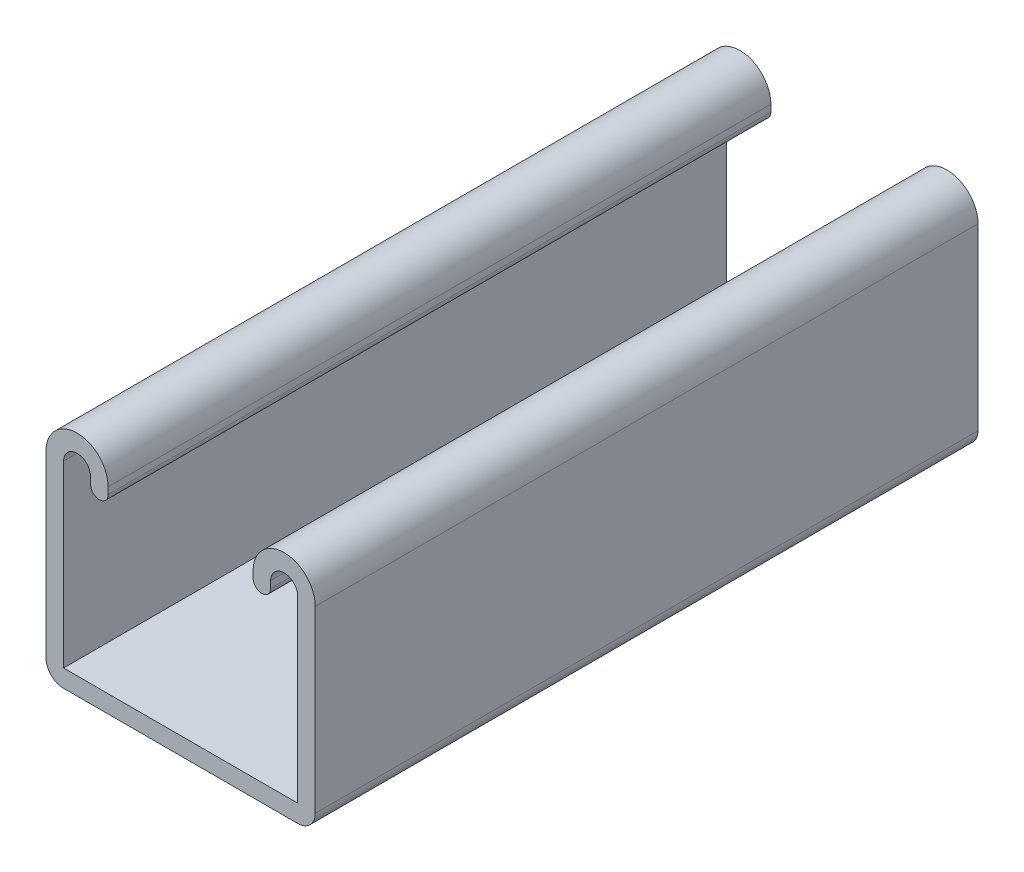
ISO-10303-21;
HEADER;
FILE_DESCRIPTION(('STEP AP214'),'2;1');
FILE_NAME('part.step','',(''),(''),'','','');
FILE_SCHEMA(('AUTOMOTIVE_DESIGN { 1 0 10303 214 1 1 1 1 }'));
ENDSEC;
DATA;
#1=APPLICATION_CONTEXT('core data for automotive mechanical design processes');
#2=APPLICATION_PROTOCOL_DEFINITION('international standard','automotive_design',2000,#1);
#3=PRODUCT_CONTEXT('',#1,'mechanical');
#4=PRODUCT('Part','Part','',(#3));
#5=PRODUCT_RELATED_PRODUCT_CATEGORY('part','',(#4));
#6=PRODUCT_DEFINITION_FORMATION('','',#4);
#7=PRODUCT_DEFINITION_CONTEXT('part definition',#1,'design');
#8=PRODUCT_DEFINITION('design','',#6,#7);
#9=PRODUCT_DEFINITION_SHAPE('','',#8);
#10=(LENGTH_UNIT() NAMED_UNIT(*) SI_UNIT(.MILLI.,.METRE.));
#11=(NAMED_UNIT(*) PLANE_ANGLE_UNIT() SI_UNIT($,.RADIAN.));
#12=(NAMED_UNIT(*) SI_UNIT($,.STERADIAN.) SOLID_ANGLE_UNIT());
#13=UNCERTAINTY_MEASURE_WITH_UNIT(LENGTH_MEASURE(1.E-05),#10,'distance_accuracy_value','');
#14=(GEOMETRIC_REPRESENTATION_CONTEXT(3) GLOBAL_UNCERTAINTY_ASSIGNED_CONTEXT((#13)) GLOBAL_UNIT_ASSIGNED_CONTEXT((#10,
#11,#12)) REPRESENTATION_CONTEXT('',''));
#15=CARTESIAN_POINT('',(0.,0.,0.));
#16=DIRECTION('',(0.,0.,1.));
#17=DIRECTION('',(1.,0.,0.));
#18=AXIS2_PLACEMENT_3D('',#15,#16,#17);
#19=CARTESIAN_POINT('',(-15.875,15.1511,101.6));
#20=DIRECTION('',(0.,0.,-1.));
#21=DIRECTION('',(-1.,0.,0.));
#22=AXIS2_PLACEMENT_3D('',#19,#20,#21);
#23=CYLINDRICAL_SURFACE('',#22,4.7625);
#24=CARTESIAN_POINT('',(-15.875,15.1511,0.));
#25=DIRECTION('',(0.,0.,1.));
#26=DIRECTION('',(-1.,0.,0.));
#27=AXIS2_PLACEMENT_3D('',#24,#25,#26);
#28=CIRCLE('',#27,4.7625);
#29=CARTESIAN_POINT('',(-11.1125,15.1511,0.));
#30=VERTEX_POINT('',#29);
#31=CARTESIAN_POINT('',(-20.6375,15.1511,0.));
#32=VERTEX_POINT('',#31);
#33=EDGE_CURVE('E190',#30,#32,#28,.T.);
#34=ORIENTED_EDGE('',*,*,#33,.T.);
#35=DIRECTION('',(0.,0.,-1.));
#36=VECTOR('',#35,1.);
#37=CARTESIAN_POINT('',(-20.6375,15.1511,101.6));
#38=LINE('',#37,#36);
#39=CARTESIAN_POINT('',(-20.6375,15.1511,101.6));
#40=VERTEX_POINT('',#39);
#41=EDGE_CURVE('E11',#40,#32,#38,.T.);
#42=ORIENTED_EDGE('',*,*,#41,.F.);
#43=CARTESIAN_POINT('',(-15.875,15.1511,101.6));
#44=DIRECTION('',(0.,0.,1.));
#45=DIRECTION('',(-1.,0.,0.));
#46=AXIS2_PLACEMENT_3D('',#43,#44,#45);
#47=CIRCLE('',#46,4.7625);
#48=CARTESIAN_POINT('',(-11.1125,15.1511,101.6));
#49=VERTEX_POINT('',#48);
#50=EDGE_CURVE('E224',#49,#40,#47,.T.);
#51=ORIENTED_EDGE('',*,*,#50,.F.);
#52=DIRECTION('',(0.,0.,-1.));
#53=VECTOR('',#52,1.);
#54=CARTESIAN_POINT('',(-11.1125,15.1511,101.6));
#55=LINE('',#54,#53);
#56=EDGE_CURVE('E186',#49,#30,#55,.T.);
#57=ORIENTED_EDGE('',*,*,#56,.T.);
#58=EDGE_LOOP('',(#34,#42,#51,#57));
#59=FACE_BOUND('',#58,.T.);
#60=ADVANCED_FACE('F33',(#59),#23,.T.);
#61=CARTESIAN_POINT('',(-20.6375,15.1511,101.6));
#62=DIRECTION('',(1.,0.,0.));
#63=DIRECTION('',(0.,1.,0.));
#64=AXIS2_PLACEMENT_3D('',#61,#62,#63);
#65=PLANE('',#64);
#66=DIRECTION('',(0.,-1.,0.));
#67=VECTOR('',#66,1.);
#68=CARTESIAN_POINT('',(-20.6375,15.1511,0.));
#69=LINE('',#68,#67);
#70=CARTESIAN_POINT('',(-20.6375,-12.319,0.));
#71=VERTEX_POINT('',#70);
#72=EDGE_CURVE('E193',#32,#71,#69,.T.);
#73=ORIENTED_EDGE('',*,*,#72,.T.);
#74=DIRECTION('',(0.,0.,-1.));
#75=VECTOR('',#74,1.);
#76=CARTESIAN_POINT('',(-20.6375,-12.319,101.6));
#77=LINE('',#76,#75);
#78=CARTESIAN_POINT('',(-20.6375,-12.319,101.6));
#79=VERTEX_POINT('',#78);
#80=EDGE_CURVE('E42',#79,#71,#77,.T.);
#81=ORIENTED_EDGE('',*,*,#80,.F.);
#82=DIRECTION('',(0.,-1.,0.));
#83=VECTOR('',#82,1.);
#84=CARTESIAN_POINT('',(-20.6375,15.1511,101.6));
#85=LINE('',#84,#83);
#86=EDGE_CURVE('E123',#40,#79,#85,.T.);
#87=ORIENTED_EDGE('',*,*,#86,.F.);
#88=ORIENTED_EDGE('',*,*,#41,.T.);
#89=EDGE_LOOP('',(#73,#81,#87,#88));
#90=FACE_BOUND('',#89,.T.);
#91=ADVANCED_FACE('F333',(#90),#65,.F.);
#92=CARTESIAN_POINT('',(-17.9451,-12.319,101.6));
#93=DIRECTION('',(0.,0.,-1.));
#94=DIRECTION('',(-1.,0.,0.));
#95=AXIS2_PLACEMENT_3D('',#92,#93,#94);
#96=CYLINDRICAL_SURFACE('',#95,2.6924);
#97=CARTESIAN_POINT('',(-17.9451,-12.319,0.));
#98=DIRECTION('',(0.,0.,1.));
#99=DIRECTION('',(-1.,0.,0.));
#100=AXIS2_PLACEMENT_3D('',#97,#98,#99);
#101=CIRCLE('',#100,2.6924);
#102=CARTESIAN_POINT('',(-17.9451,-15.0114,0.));
#103=VERTEX_POINT('',#102);
#104=EDGE_CURVE('E195',#71,#103,#101,.T.);
#105=ORIENTED_EDGE('',*,*,#104,.T.);
#106=DIRECTION('',(0.,0.,-1.));
#107=VECTOR('',#106,1.);
#108=CARTESIAN_POINT('',(-17.9451,-15.0114,101.6));
#109=LINE('',#108,#107);
#110=CARTESIAN_POINT('',(-17.9451,-15.0114,101.6));
#111=VERTEX_POINT('',#110);
#112=EDGE_CURVE('E261',#111,#103,#109,.T.);
#113=ORIENTED_EDGE('',*,*,#112,.F.);
#114=CARTESIAN_POINT('',(-17.9451,-12.319,101.6));
#115=DIRECTION('',(0.,0.,1.));
#116=DIRECTION('',(-1.,0.,0.));
#117=AXIS2_PLACEMENT_3D('',#114,#115,#116);
#118=CIRCLE('',#117,2.6924);
#119=EDGE_CURVE('E270',#79,#111,#118,.T.);
#120=ORIENTED_EDGE('',*,*,#119,.F.);
#121=ORIENTED_EDGE('',*,*,#80,.T.);
#122=EDGE_LOOP('',(#105,#113,#120,#121));
#123=FACE_BOUND('',#122,.T.);
#124=ADVANCED_FACE('F268',(#123),#96,.T.);
#125=CARTESIAN_POINT('',(-17.9451,-15.0114,101.6));
#126=DIRECTION('',(0.,1.,0.));
#127=DIRECTION('',(-1.,0.,0.));
#128=AXIS2_PLACEMENT_3D('',#125,#126,#127);
#129=PLANE('',#128);
#130=CARTESIAN_POINT('',(0.,-15.0114,71.4375));
#131=DIRECTION('',(0.,-1.,0.));
#132=DIRECTION('',(1.,0.,0.));
#133=AXIS2_PLACEMENT_3D('',#130,#131,#132);
#134=CIRCLE('',#133,7.14375);
#135=CARTESIAN_POINT('',(7.14375,-15.0114,71.4375));
#136=VERTEX_POINT('',#135);
#137=EDGE_CURVE('E452',#136,#136,#134,.T.);
#138=ORIENTED_EDGE('',*,*,#137,.F.);
#139=EDGE_LOOP('',(#138));
#140=FACE_BOUND('',#139,.T.);
#141=CARTESIAN_POINT('',(0.,-15.0114,23.8125));
#142=DIRECTION('',(0.,-1.,0.));
#143=DIRECTION('',(1.,0.,0.));
#144=AXIS2_PLACEMENT_3D('',#141,#142,#143);
#145=CIRCLE('',#144,7.14375);
#146=CARTESIAN_POINT('',(7.14375,-15.0114,23.8125));
#147=VERTEX_POINT('',#146);
#148=EDGE_CURVE('E456',#147,#147,#145,.T.);
#149=ORIENTED_EDGE('',*,*,#148,.F.);
#150=EDGE_LOOP('',(#149));
#151=FACE_BOUND('',#150,.T.);
#152=DIRECTION('',(1.,0.,0.));
#153=VECTOR('',#152,1.);
#154=CARTESIAN_POINT('',(-17.9451,-15.0114,0.));
#155=LINE('',#154,#153);
#156=CARTESIAN_POINT('',(17.9451,-15.0114,0.));
#157=VERTEX_POINT('',#156);
#158=EDGE_CURVE('E197',#103,#157,#155,.T.);
#159=ORIENTED_EDGE('',*,*,#158,.T.);
#160=DIRECTION('',(0.,0.,-1.));
#161=VECTOR('',#160,1.);
#162=CARTESIAN_POINT('',(17.9451,-15.0114,101.6));
#163=LINE('',#162,#161);
#164=CARTESIAN_POINT('',(17.9451,-15.0114,101.6));
#165=VERTEX_POINT('',#164);
#166=EDGE_CURVE('E258',#165,#157,#163,.T.);
#167=ORIENTED_EDGE('',*,*,#166,.F.);
#168=DIRECTION('',(1.,0.,0.));
#169=VECTOR('',#168,1.);
#170=CARTESIAN_POINT('',(-17.9451,-15.0114,101.6));
#171=LINE('',#170,#169);
#172=EDGE_CURVE('E288',#111,#165,#171,.T.);
#173=ORIENTED_EDGE('',*,*,#172,.F.);
#174=ORIENTED_EDGE('',*,*,#112,.T.);
#175=EDGE_LOOP('',(#159,#167,#173,#174));
#176=FACE_BOUND('',#175,.T.);
#177=ADVANCED_FACE('F279',(#140,#151,#176),#129,.F.);
#178=CARTESIAN_POINT('',(17.9451,-12.319,101.6));
#179=DIRECTION('',(0.,0.,-1.));
#180=DIRECTION('',(-1.,0.,0.));
#181=AXIS2_PLACEMENT_3D('',#178,#179,#180);
#182=CYLINDRICAL_SURFACE('',#181,2.6924);
#183=CARTESIAN_POINT('',(17.9451,-12.319,0.));
#184=DIRECTION('',(0.,0.,1.));
#185=DIRECTION('',(1.,0.,0.));
#186=AXIS2_PLACEMENT_3D('',#183,#184,#185);
#187=CIRCLE('',#186,2.6924);
#188=CARTESIAN_POINT('',(20.6375,-12.319,0.));
#189=VERTEX_POINT('',#188);
#190=EDGE_CURVE('E199',#157,#189,#187,.T.);
#191=ORIENTED_EDGE('',*,*,#190,.T.);
#192=DIRECTION('',(0.,0.,-1.));
#193=VECTOR('',#192,1.);
#194=CARTESIAN_POINT('',(20.6375,-12.319,101.6));
#195=LINE('',#194,#193);
#196=CARTESIAN_POINT('',(20.6375,-12.319,101.6));
#197=VERTEX_POINT('',#196);
#198=EDGE_CURVE('E255',#197,#189,#195,.T.);
#199=ORIENTED_EDGE('',*,*,#198,.F.);
#200=CARTESIAN_POINT('',(17.9451,-12.319,101.6));
#201=DIRECTION('',(0.,0.,1.));
#202=DIRECTION('',(1.,0.,0.));
#203=AXIS2_PLACEMENT_3D('',#200,#201,#202);
#204=CIRCLE('',#203,2.6924);
#205=EDGE_CURVE('E285',#165,#197,#204,.T.);
#206=ORIENTED_EDGE('',*,*,#205,.F.);
#207=ORIENTED_EDGE('',*,*,#166,.T.);
#208=EDGE_LOOP('',(#191,#199,#206,#207));
#209=FACE_BOUND('',#208,.T.);
#210=ADVANCED_FACE('F283',(#209),#182,.T.);
#211=CARTESIAN_POINT('',(20.6375,-12.319,101.6));
#212=DIRECTION('',(-1.,0.,0.));
#213=DIRECTION('',(0.,0.,1.));
#214=AXIS2_PLACEMENT_3D('',#211,#212,#213);
#215=PLANE('',#214);
#216=DIRECTION('',(0.,1.,0.));
#217=VECTOR('',#216,1.);
#218=CARTESIAN_POINT('',(20.6375,-12.319,0.));
#219=LINE('',#218,#217);
#220=CARTESIAN_POINT('',(20.6375,15.1511,0.));
#221=VERTEX_POINT('',#220);
#222=EDGE_CURVE('E201',#189,#221,#219,.T.);
#223=ORIENTED_EDGE('',*,*,#222,.T.);
#224=DIRECTION('',(0.,0.,-1.));
#225=VECTOR('',#224,1.);
#226=CARTESIAN_POINT('',(20.6375,15.1511,101.6));
#227=LINE('',#226,#225);
#228=CARTESIAN_POINT('',(20.6375,15.1511,101.6));
#229=VERTEX_POINT('',#228);
#230=EDGE_CURVE('E252',#229,#221,#227,.T.);
#231=ORIENTED_EDGE('',*,*,#230,.F.);
#232=DIRECTION('',(0.,1.,0.));
#233=VECTOR('',#232,1.);
#234=CARTESIAN_POINT('',(20.6375,-12.319,101.6));
#235=LINE('',#234,#233);
#236=EDGE_CURVE('E287',#197,#229,#235,.T.);
#237=ORIENTED_EDGE('',*,*,#236,.F.);
#238=ORIENTED_EDGE('',*,*,#198,.T.);
#239=EDGE_LOOP('',(#223,#231,#237,#238));
#240=FACE_BOUND('',#239,.T.);
#241=ADVANCED_FACE('F347',(#240),#215,.F.);
#242=CARTESIAN_POINT('',(15.875,15.1511,101.6));
#243=DIRECTION('',(0.,0.,-1.));
#244=DIRECTION('',(-1.,0.,0.));
#245=AXIS2_PLACEMENT_3D('',#242,#243,#244);
#246=CYLINDRICAL_SURFACE('',#245,4.7625);
#247=CARTESIAN_POINT('',(15.875,15.1511,0.));
#248=DIRECTION('',(0.,0.,1.));
#249=DIRECTION('',(1.,0.,0.));
#250=AXIS2_PLACEMENT_3D('',#247,#248,#249);
#251=CIRCLE('',#250,4.7625);
#252=CARTESIAN_POINT('',(11.1125,15.1511,0.));
#253=VERTEX_POINT('',#252);
#254=EDGE_CURVE('E203',#221,#253,#251,.T.);
#255=ORIENTED_EDGE('',*,*,#254,.T.);
#256=DIRECTION('',(0.,0.,-1.));
#257=VECTOR('',#256,1.);
#258=CARTESIAN_POINT('',(11.1125,15.1511,101.6));
#259=LINE('',#258,#257);
#260=CARTESIAN_POINT('',(11.1125,15.1511,101.6));
#261=VERTEX_POINT('',#260);
#262=EDGE_CURVE('E249',#261,#253,#259,.T.);
#263=ORIENTED_EDGE('',*,*,#262,.F.);
#264=CARTESIAN_POINT('',(15.875,15.1511,101.6));
#265=DIRECTION('',(0.,0.,1.));
#266=DIRECTION('',(1.,0.,0.));
#267=AXIS2_PLACEMENT_3D('',#264,#265,#266);
#268=CIRCLE('',#267,4.7625);
#269=EDGE_CURVE('E290',#229,#261,#268,.T.);
#270=ORIENTED_EDGE('',*,*,#269,.F.);
#271=ORIENTED_EDGE('',*,*,#230,.T.);
#272=EDGE_LOOP('',(#255,#263,#270,#271));
#273=FACE_BOUND('',#272,.T.);
#274=ADVANCED_FACE('F350',(#273),#246,.T.);
#275=CARTESIAN_POINT('',(11.1125,15.1511,101.6));
#276=DIRECTION('',(1.,0.,0.));
#277=DIRECTION('',(0.,1.,0.));
#278=AXIS2_PLACEMENT_3D('',#275,#276,#277);
#279=PLANE('',#278);
#280=DIRECTION('',(0.,-1.,0.));
#281=VECTOR('',#280,1.);
#282=CARTESIAN_POINT('',(11.1125,15.1511,0.));
#283=LINE('',#282,#281);
#284=CARTESIAN_POINT('',(11.1125,14.11605,0.));
#285=VERTEX_POINT('',#284);
#286=EDGE_CURVE('E205',#253,#285,#283,.T.);
#287=ORIENTED_EDGE('',*,*,#286,.T.);
#288=DIRECTION('',(0.,0.,-1.));
#289=VECTOR('',#288,1.);
#290=CARTESIAN_POINT('',(11.1125,14.11605,101.6));
#291=LINE('',#290,#289);
#292=CARTESIAN_POINT('',(11.1125,14.11605,101.6));
#293=VERTEX_POINT('',#292);
#294=EDGE_CURVE('E246',#293,#285,#291,.T.);
#295=ORIENTED_EDGE('',*,*,#294,.F.);
#296=DIRECTION('',(0.,-1.,0.));
#297=VECTOR('',#296,1.);
#298=CARTESIAN_POINT('',(11.1125,15.1511,101.6));
#299=LINE('',#298,#297);
#300=EDGE_CURVE('E296',#261,#293,#299,.T.);
#301=ORIENTED_EDGE('',*,*,#300,.F.);
#302=ORIENTED_EDGE('',*,*,#262,.T.);
#303=EDGE_LOOP('',(#287,#295,#301,#302));
#304=FACE_BOUND('',#303,.T.);
#305=ADVANCED_FACE('F354',(#304),#279,.F.);
#306=CARTESIAN_POINT('',(12.4587,14.11605,101.6));
#307=DIRECTION('',(0.,0.,-1.));
#308=DIRECTION('',(-1.,0.,0.));
#309=AXIS2_PLACEMENT_3D('',#306,#307,#308);
#310=CYLINDRICAL_SURFACE('',#309,1.3462);
#311=CARTESIAN_POINT('',(12.4587,14.11605,0.));
#312=DIRECTION('',(0.,0.,1.));
#313=DIRECTION('',(1.,0.,0.));
#314=AXIS2_PLACEMENT_3D('',#311,#312,#313);
#315=CIRCLE('',#314,1.3462);
#316=CARTESIAN_POINT('',(13.8049,14.11605,0.));
#317=VERTEX_POINT('',#316);
#318=EDGE_CURVE('E207',#285,#317,#315,.T.);
#319=ORIENTED_EDGE('',*,*,#318,.T.);
#320=DIRECTION('',(0.,0.,-1.));
#321=VECTOR('',#320,1.);
#322=CARTESIAN_POINT('',(13.8049,14.11605,101.6));
#323=LINE('',#322,#321);
#324=CARTESIAN_POINT('',(13.8049,14.11605,101.6));
#325=VERTEX_POINT('',#324);
#326=EDGE_CURVE('E243',#325,#317,#323,.T.);
#327=ORIENTED_EDGE('',*,*,#326,.F.);
#328=CARTESIAN_POINT('',(12.4587,14.11605,101.6));
#329=DIRECTION('',(0.,0.,1.));
#330=DIRECTION('',(1.,0.,0.));
#331=AXIS2_PLACEMENT_3D('',#328,#329,#330);
#332=CIRCLE('',#331,1.3462);
#333=EDGE_CURVE('E298',#293,#325,#332,.T.);
#334=ORIENTED_EDGE('',*,*,#333,.F.);
#335=ORIENTED_EDGE('',*,*,#294,.T.);
#336=EDGE_LOOP('',(#319,#327,#334,#335));
#337=FACE_BOUND('',#336,.T.);
#338=ADVANCED_FACE('F358',(#337),#310,.T.);
#339=CARTESIAN_POINT('',(13.8049,15.1511,101.6));
#340=DIRECTION('',(-1.,0.,0.));
#341=DIRECTION('',(0.,0.,1.));
#342=AXIS2_PLACEMENT_3D('',#339,#340,#341);
#343=PLANE('',#342);
#344=DIRECTION('',(0.,1.,0.));
#345=VECTOR('',#344,1.);
#346=CARTESIAN_POINT('',(13.8049,15.1511,0.));
#347=LINE('',#346,#345);
#348=CARTESIAN_POINT('',(13.8049,15.1511,0.));
#349=VERTEX_POINT('',#348);
#350=EDGE_CURVE('E209',#317,#349,#347,.T.);
#351=ORIENTED_EDGE('',*,*,#350,.T.);
#352=DIRECTION('',(0.,0.,-1.));
#353=VECTOR('',#352,1.);
#354=CARTESIAN_POINT('',(13.8049,15.1511,101.6));
#355=LINE('',#354,#353);
#356=CARTESIAN_POINT('',(13.8049,15.1511,101.6));
#357=VERTEX_POINT('',#356);
#358=EDGE_CURVE('E240',#357,#349,#355,.T.);
#359=ORIENTED_EDGE('',*,*,#358,.F.);
#360=DIRECTION('',(0.,1.,0.));
#361=VECTOR('',#360,1.);
#362=CARTESIAN_POINT('',(13.8049,15.1511,101.6));
#363=LINE('',#362,#361);
#364=EDGE_CURVE('E300',#325,#357,#363,.T.);
#365=ORIENTED_EDGE('',*,*,#364,.F.);
#366=ORIENTED_EDGE('',*,*,#326,.T.);
#367=EDGE_LOOP('',(#351,#359,#365,#366));
#368=FACE_BOUND('',#367,.T.);
#369=ADVANCED_FACE('F362',(#368),#343,.F.);
#370=CARTESIAN_POINT('',(15.875,15.1511,101.6));
#371=DIRECTION('',(0.,0.,-1.));
#372=DIRECTION('',(-1.,0.,0.));
#373=AXIS2_PLACEMENT_3D('',#370,#371,#372);
#374=CYLINDRICAL_SURFACE('',#373,2.0701);
#375=CARTESIAN_POINT('',(15.875,15.1511,0.));
#376=DIRECTION('',(0.,0.,-1.));
#377=DIRECTION('',(1.,0.,0.));
#378=AXIS2_PLACEMENT_3D('',#375,#376,#377);
#379=CIRCLE('',#378,2.0701);
#380=CARTESIAN_POINT('',(17.9451,15.1511,0.));
#381=VERTEX_POINT('',#380);
#382=EDGE_CURVE('E211',#349,#381,#379,.T.);
#383=ORIENTED_EDGE('',*,*,#382,.T.);
#384=DIRECTION('',(0.,0.,-1.));
#385=VECTOR('',#384,1.);
#386=CARTESIAN_POINT('',(17.9451,15.1511,101.6));
#387=LINE('',#386,#385);
#388=CARTESIAN_POINT('',(17.9451,15.1511,101.6));
#389=VERTEX_POINT('',#388);
#390=EDGE_CURVE('E237',#389,#381,#387,.T.);
#391=ORIENTED_EDGE('',*,*,#390,.F.);
#392=CARTESIAN_POINT('',(15.875,15.1511,101.6));
#393=DIRECTION('',(0.,0.,-1.));
#394=DIRECTION('',(1.,0.,0.));
#395=AXIS2_PLACEMENT_3D('',#392,#393,#394);
#396=CIRCLE('',#395,2.0701);
#397=EDGE_CURVE('E302',#357,#389,#396,.T.);
#398=ORIENTED_EDGE('',*,*,#397,.F.);
#399=ORIENTED_EDGE('',*,*,#358,.T.);
#400=EDGE_LOOP('',(#383,#391,#398,#399));
#401=FACE_BOUND('',#400,.T.);
#402=ADVANCED_FACE('F366',(#401),#374,.F.);
#403=CARTESIAN_POINT('',(17.9451,-12.319,101.6));
#404=DIRECTION('',(1.,0.,0.));
#405=DIRECTION('',(0.,1.,0.));
#406=AXIS2_PLACEMENT_3D('',#403,#404,#405);
#407=PLANE('',#406);
#408=DIRECTION('',(0.,-1.,0.));
#409=VECTOR('',#408,1.);
#410=CARTESIAN_POINT('',(17.9451,-12.319,0.));
#411=LINE('',#410,#409);
#412=CARTESIAN_POINT('',(17.9451,-12.319,0.));
#413=VERTEX_POINT('',#412);
#414=EDGE_CURVE('E213',#381,#413,#411,.T.);
#415=ORIENTED_EDGE('',*,*,#414,.T.);
#416=DIRECTION('',(0.,0.,-1.));
#417=VECTOR('',#416,1.);
#418=CARTESIAN_POINT('',(17.9451,-12.319,101.6));
#419=LINE('',#418,#417);
#420=CARTESIAN_POINT('',(17.9451,-12.319,101.6));
#421=VERTEX_POINT('',#420);
#422=EDGE_CURVE('E234',#421,#413,#419,.T.);
#423=ORIENTED_EDGE('',*,*,#422,.F.);
#424=DIRECTION('',(0.,-1.,0.));
#425=VECTOR('',#424,1.);
#426=CARTESIAN_POINT('',(17.9451,-12.319,101.6));
#427=LINE('',#426,#425);
#428=EDGE_CURVE('E304',#389,#421,#427,.T.);
#429=ORIENTED_EDGE('',*,*,#428,.F.);
#430=ORIENTED_EDGE('',*,*,#390,.T.);
#431=EDGE_LOOP('',(#415,#423,#429,#430));
#432=FACE_BOUND('',#431,.T.);
#433=ADVANCED_FACE('F370',(#432),#407,.F.);
#434=CARTESIAN_POINT('',(-17.9451,-12.319,101.6));
#435=DIRECTION('',(0.,-1.,0.));
#436=DIRECTION('',(0.,0.,-1.));
#437=AXIS2_PLACEMENT_3D('',#434,#435,#436);
#438=PLANE('',#437);
#439=CARTESIAN_POINT('',(0.,-12.319,71.4375));
#440=DIRECTION('',(0.,-1.,0.));
#441=DIRECTION('',(0.,0.,-1.));
#442=AXIS2_PLACEMENT_3D('',#439,#440,#441);
#443=CIRCLE('',#442,7.14375);
#444=CARTESIAN_POINT('',(0.,-12.319,64.29375));
#445=VERTEX_POINT('',#444);
#446=EDGE_CURVE('E455',#445,#445,#443,.T.);
#447=ORIENTED_EDGE('',*,*,#446,.T.);
#448=EDGE_LOOP('',(#447));
#449=FACE_BOUND('',#448,.T.);
#450=CARTESIAN_POINT('',(0.,-12.319,23.8125));
#451=DIRECTION('',(0.,-1.,0.));
#452=DIRECTION('',(0.,0.,-1.));
#453=AXIS2_PLACEMENT_3D('',#450,#451,#452);
#454=CIRCLE('',#453,7.14375);
#455=CARTESIAN_POINT('',(0.,-12.319,16.66875));
#456=VERTEX_POINT('',#455);
#457=EDGE_CURVE('E36',#456,#456,#454,.T.);
#458=ORIENTED_EDGE('',*,*,#457,.T.);
#459=EDGE_LOOP('',(#458));
#460=FACE_BOUND('',#459,.T.);
#461=DIRECTION('',(-1.,0.,0.));
#462=VECTOR('',#461,1.);
#463=CARTESIAN_POINT('',(-17.9451,-12.319,0.));
#464=LINE('',#463,#462);
#465=CARTESIAN_POINT('',(-17.9451,-12.319,0.));
#466=VERTEX_POINT('',#465);
#467=EDGE_CURVE('E215',#413,#466,#464,.T.);
#468=ORIENTED_EDGE('',*,*,#467,.T.);
#469=DIRECTION('',(0.,0.,-1.));
#470=VECTOR('',#469,1.);
#471=CARTESIAN_POINT('',(-17.9451,-12.319,101.6));
#472=LINE('',#471,#470);
#473=CARTESIAN_POINT('',(-17.9451,-12.319,101.6));
#474=VERTEX_POINT('',#473);
#475=EDGE_CURVE('E231',#474,#466,#472,.T.);
#476=ORIENTED_EDGE('',*,*,#475,.F.);
#477=DIRECTION('',(-1.,0.,0.));
#478=VECTOR('',#477,1.);
#479=CARTESIAN_POINT('',(-17.9451,-12.319,101.6));
#480=LINE('',#479,#478);
#481=EDGE_CURVE('E306',#421,#474,#480,.T.);
#482=ORIENTED_EDGE('',*,*,#481,.F.);
#483=ORIENTED_EDGE('',*,*,#422,.T.);
#484=EDGE_LOOP('',(#468,#476,#482,#483));
#485=FACE_BOUND('',#484,.T.);
#486=ADVANCED_FACE('F374',(#449,#460,#485),#438,.F.);
#487=CARTESIAN_POINT('',(-17.9451,15.1511,101.6));
#488=DIRECTION('',(-1.,0.,0.));
#489=DIRECTION('',(0.,0.,1.));
#490=AXIS2_PLACEMENT_3D('',#487,#488,#489);
#491=PLANE('',#490);
#492=DIRECTION('',(0.,1.,0.));
#493=VECTOR('',#492,1.);
#494=CARTESIAN_POINT('',(-17.9451,15.1511,0.));
#495=LINE('',#494,#493);
#496=CARTESIAN_POINT('',(-17.9451,15.1511,0.));
#497=VERTEX_POINT('',#496);
#498=EDGE_CURVE('E217',#466,#497,#495,.T.);
#499=ORIENTED_EDGE('',*,*,#498,.T.);
#500=DIRECTION('',(0.,0.,-1.));
#501=VECTOR('',#500,1.);
#502=CARTESIAN_POINT('',(-17.9451,15.1511,101.6));
#503=LINE('',#502,#501);
#504=CARTESIAN_POINT('',(-17.9451,15.1511,101.6));
#505=VERTEX_POINT('',#504);
#506=EDGE_CURVE('E228',#505,#497,#503,.T.);
#507=ORIENTED_EDGE('',*,*,#506,.F.);
#508=DIRECTION('',(0.,1.,0.));
#509=VECTOR('',#508,1.);
#510=CARTESIAN_POINT('',(-17.9451,15.1511,101.6));
#511=LINE('',#510,#509);
#512=EDGE_CURVE('E308',#474,#505,#511,.T.);
#513=ORIENTED_EDGE('',*,*,#512,.F.);
#514=ORIENTED_EDGE('',*,*,#475,.T.);
#515=EDGE_LOOP('',(#499,#507,#513,#514));
#516=FACE_BOUND('',#515,.T.);
#517=ADVANCED_FACE('F314',(#516),#491,.F.);
#518=CARTESIAN_POINT('',(-15.875,15.1511,101.6));
#519=DIRECTION('',(0.,0.,-1.));
#520=DIRECTION('',(-1.,0.,0.));
#521=AXIS2_PLACEMENT_3D('',#518,#519,#520);
#522=CYLINDRICAL_SURFACE('',#521,2.0701);
#523=CARTESIAN_POINT('',(-15.875,15.1511,0.));
#524=DIRECTION('',(0.,0.,-1.));
#525=DIRECTION('',(-1.,0.,0.));
#526=AXIS2_PLACEMENT_3D('',#523,#524,#525);
#527=CIRCLE('',#526,2.0701);
#528=CARTESIAN_POINT('',(-13.8049,15.1511,0.));
#529=VERTEX_POINT('',#528);
#530=EDGE_CURVE('E219',#497,#529,#527,.T.);
#531=ORIENTED_EDGE('',*,*,#530,.T.);
#532=DIRECTION('',(0.,0.,-1.));
#533=VECTOR('',#532,1.);
#534=CARTESIAN_POINT('',(-13.8049,15.1511,101.6));
#535=LINE('',#534,#533);
#536=CARTESIAN_POINT('',(-13.8049,15.1511,101.6));
#537=VERTEX_POINT('',#536);
#538=EDGE_CURVE('E181',#537,#529,#535,.T.);
#539=ORIENTED_EDGE('',*,*,#538,.F.);
#540=CARTESIAN_POINT('',(-15.875,15.1511,101.6));
#541=DIRECTION('',(0.,0.,-1.));
#542=DIRECTION('',(-1.,0.,0.));
#543=AXIS2_PLACEMENT_3D('',#540,#541,#542);
#544=CIRCLE('',#543,2.0701);
#545=EDGE_CURVE('E172',#505,#537,#544,.T.);
#546=ORIENTED_EDGE('',*,*,#545,.F.);
#547=ORIENTED_EDGE('',*,*,#506,.T.);
#548=EDGE_LOOP('',(#531,#539,#546,#547));
#549=FACE_BOUND('',#548,.T.);
#550=ADVANCED_FACE('F318',(#549),#522,.F.);
#551=CARTESIAN_POINT('',(-13.8049,15.1511,101.6));
#552=DIRECTION('',(1.,0.,0.));
#553=DIRECTION('',(0.,1.,0.));
#554=AXIS2_PLACEMENT_3D('',#551,#552,#553);
#555=PLANE('',#554);
#556=DIRECTION('',(0.,-1.,0.));
#557=VECTOR('',#556,1.);
#558=CARTESIAN_POINT('',(-13.8049,15.1511,0.));
#559=LINE('',#558,#557);
#560=CARTESIAN_POINT('',(-13.8049,14.11605,0.));
#561=VERTEX_POINT('',#560);
#562=EDGE_CURVE('E180',#529,#561,#559,.T.);
#563=ORIENTED_EDGE('',*,*,#562,.T.);
#564=DIRECTION('',(0.,0.,-1.));
#565=VECTOR('',#564,1.);
#566=CARTESIAN_POINT('',(-13.8049,14.11605,101.6));
#567=LINE('',#566,#565);
#568=CARTESIAN_POINT('',(-13.8049,14.11605,101.6));
#569=VERTEX_POINT('',#568);
#570=EDGE_CURVE('E177',#569,#561,#567,.T.);
#571=ORIENTED_EDGE('',*,*,#570,.F.);
#572=DIRECTION('',(0.,-1.,0.));
#573=VECTOR('',#572,1.);
#574=CARTESIAN_POINT('',(-13.8049,15.1511,101.6));
#575=LINE('',#574,#573);
#576=EDGE_CURVE('E166',#537,#569,#575,.T.);
#577=ORIENTED_EDGE('',*,*,#576,.F.);
#578=ORIENTED_EDGE('',*,*,#538,.T.);
#579=EDGE_LOOP('',(#563,#571,#577,#578));
#580=FACE_BOUND('',#579,.T.);
#581=ADVANCED_FACE('F178',(#580),#555,.F.);
#582=CARTESIAN_POINT('',(-12.4587,14.11605,101.6));
#583=DIRECTION('',(0.,0.,-1.));
#584=DIRECTION('',(-1.,0.,0.));
#585=AXIS2_PLACEMENT_3D('',#582,#583,#584);
#586=CYLINDRICAL_SURFACE('',#585,1.3462);
#587=CARTESIAN_POINT('',(-12.4587,14.11605,0.));
#588=DIRECTION('',(0.,0.,1.));
#589=DIRECTION('',(-1.,0.,0.));
#590=AXIS2_PLACEMENT_3D('',#587,#588,#589);
#591=CIRCLE('',#590,1.3462);
#592=CARTESIAN_POINT('',(-11.1125,14.11605,0.));
#593=VERTEX_POINT('',#592);
#594=EDGE_CURVE('E109',#561,#593,#591,.T.);
#595=ORIENTED_EDGE('',*,*,#594,.T.);
#596=DIRECTION('',(0.,0.,-1.));
#597=VECTOR('',#596,1.);
#598=CARTESIAN_POINT('',(-11.1125,14.11605,101.6));
#599=LINE('',#598,#597);
#600=CARTESIAN_POINT('',(-11.1125,14.11605,101.6));
#601=VERTEX_POINT('',#600);
#602=EDGE_CURVE('E182',#601,#593,#599,.T.);
#603=ORIENTED_EDGE('',*,*,#602,.F.);
#604=CARTESIAN_POINT('',(-12.4587,14.11605,101.6));
#605=DIRECTION('',(0.,0.,1.));
#606=DIRECTION('',(-1.,0.,0.));
#607=AXIS2_PLACEMENT_3D('',#604,#605,#606);
#608=CIRCLE('',#607,1.3462);
#609=EDGE_CURVE('E170',#569,#601,#608,.T.);
#610=ORIENTED_EDGE('',*,*,#609,.F.);
#611=ORIENTED_EDGE('',*,*,#570,.T.);
#612=EDGE_LOOP('',(#595,#603,#610,#611));
#613=FACE_BOUND('',#612,.T.);
#614=ADVANCED_FACE('F184',(#613),#586,.T.);
#615=CARTESIAN_POINT('',(-11.1125,15.1511,101.6));
#616=DIRECTION('',(-1.,0.,0.));
#617=DIRECTION('',(0.,0.,1.));
#618=AXIS2_PLACEMENT_3D('',#615,#616,#617);
#619=PLANE('',#618);
#620=DIRECTION('',(0.,1.,0.));
#621=VECTOR('',#620,1.);
#622=CARTESIAN_POINT('',(-11.1125,15.1511,0.));
#623=LINE('',#622,#621);
#624=EDGE_CURVE('E115',#593,#30,#623,.T.);
#625=ORIENTED_EDGE('',*,*,#624,.T.);
#626=ORIENTED_EDGE('',*,*,#56,.F.);
#627=DIRECTION('',(0.,1.,0.));
#628=VECTOR('',#627,1.);
#629=CARTESIAN_POINT('',(-11.1125,15.1511,101.6));
#630=LINE('',#629,#628);
#631=EDGE_CURVE('E50',#601,#49,#630,.T.);
#632=ORIENTED_EDGE('',*,*,#631,.F.);
#633=ORIENTED_EDGE('',*,*,#602,.T.);
#634=EDGE_LOOP('',(#625,#626,#632,#633));
#635=FACE_BOUND('',#634,.T.);
#636=ADVANCED_FACE('F322',(#635),#619,.F.);
#637=CARTESIAN_POINT('',(-15.875,15.1511,101.6));
#638=DIRECTION('',(0.,0.,-1.));
#639=DIRECTION('',(-1.,0.,0.));
#640=AXIS2_PLACEMENT_3D('',#637,#638,#639);
#641=PLANE('',#640);
#642=ORIENTED_EDGE('',*,*,#50,.T.);
#643=ORIENTED_EDGE('',*,*,#86,.T.);
#644=ORIENTED_EDGE('',*,*,#119,.T.);
#645=ORIENTED_EDGE('',*,*,#172,.T.);
#646=ORIENTED_EDGE('',*,*,#205,.T.);
#647=ORIENTED_EDGE('',*,*,#236,.T.);
#648=ORIENTED_EDGE('',*,*,#269,.T.);
#649=ORIENTED_EDGE('',*,*,#300,.T.);
#650=ORIENTED_EDGE('',*,*,#333,.T.);
#651=ORIENTED_EDGE('',*,*,#364,.T.);
#652=ORIENTED_EDGE('',*,*,#397,.T.);
#653=ORIENTED_EDGE('',*,*,#428,.T.);
#654=ORIENTED_EDGE('',*,*,#481,.T.);
#655=ORIENTED_EDGE('',*,*,#512,.T.);
#656=ORIENTED_EDGE('',*,*,#545,.T.);
#657=ORIENTED_EDGE('',*,*,#576,.T.);
#658=ORIENTED_EDGE('',*,*,#609,.T.);
#659=ORIENTED_EDGE('',*,*,#631,.T.);
#660=EDGE_LOOP('',(#642,#643,#644,#645,#646,#647,#648,#649,#650,#651,#652,#653,#654,#655,#656,
#657,#658,#659));
#661=FACE_BOUND('',#660,.T.);
#662=ADVANCED_FACE('F168',(#661),#641,.F.);
#663=CARTESIAN_POINT('',(-15.875,15.1511,0.));
#664=DIRECTION('',(0.,0.,-1.));
#665=DIRECTION('',(-1.,0.,0.));
#666=AXIS2_PLACEMENT_3D('',#663,#664,#665);
#667=PLANE('',#666);
#668=ORIENTED_EDGE('',*,*,#33,.F.);
#669=ORIENTED_EDGE('',*,*,#624,.F.);
#670=ORIENTED_EDGE('',*,*,#594,.F.);
#671=ORIENTED_EDGE('',*,*,#562,.F.);
#672=ORIENTED_EDGE('',*,*,#530,.F.);
#673=ORIENTED_EDGE('',*,*,#498,.F.);
#674=ORIENTED_EDGE('',*,*,#467,.F.);
#675=ORIENTED_EDGE('',*,*,#414,.F.);
#676=ORIENTED_EDGE('',*,*,#382,.F.);
#677=ORIENTED_EDGE('',*,*,#350,.F.);
#678=ORIENTED_EDGE('',*,*,#318,.F.);
#679=ORIENTED_EDGE('',*,*,#286,.F.);
#680=ORIENTED_EDGE('',*,*,#254,.F.);
#681=ORIENTED_EDGE('',*,*,#222,.F.);
#682=ORIENTED_EDGE('',*,*,#190,.F.);
#683=ORIENTED_EDGE('',*,*,#158,.F.);
#684=ORIENTED_EDGE('',*,*,#104,.F.);
#685=ORIENTED_EDGE('',*,*,#72,.F.);
#686=EDGE_LOOP('',(#668,#669,#670,#671,#672,#673,#674,#675,#676,#677,#678,#679,#680,#681,#682,
#683,#684,#685));
#687=FACE_BOUND('',#686,.T.);
#688=ADVANCED_FACE('F274',(#687),#667,.T.);
#689=CARTESIAN_POINT('',(0.,19.9136,23.8125));
#690=DIRECTION('',(0.,-1.,0.));
#691=DIRECTION('',(1.,0.,0.));
#692=AXIS2_PLACEMENT_3D('',#689,#690,#691);
#693=CYLINDRICAL_SURFACE('',#692,7.14375);
#694=ORIENTED_EDGE('',*,*,#148,.T.);
#695=EDGE_LOOP('',(#694));
#696=FACE_BOUND('',#695,.T.);
#697=ORIENTED_EDGE('',*,*,#457,.F.);
#698=EDGE_LOOP('',(#697));
#699=FACE_BOUND('',#698,.T.);
#700=ADVANCED_FACE('F411',(#696,#699),#693,.F.);
#701=CARTESIAN_POINT('',(0.,19.9136,71.4375));
#702=DIRECTION('',(0.,-1.,0.));
#703=DIRECTION('',(1.,0.,0.));
#704=AXIS2_PLACEMENT_3D('',#701,#702,#703);
#705=CYLINDRICAL_SURFACE('',#704,7.14375);
#706=ORIENTED_EDGE('',*,*,#137,.T.);
#707=EDGE_LOOP('',(#706));
#708=FACE_BOUND('',#707,.T.);
#709=ORIENTED_EDGE('',*,*,#446,.F.);
#710=EDGE_LOOP('',(#709));
#711=FACE_BOUND('',#710,.T.);
#712=ADVANCED_FACE('F419',(#708,#711),#705,.F.);
#713=CLOSED_SHELL('',(#60,#91,#124,#177,#210,#241,#274,#305,#338,#369,#402,#433,#486,#517,#550,
#581,#614,#636,#662,#688,#700,#712));
#714=MANIFOLD_SOLID_BREP('B2',#713);
#715=ADVANCED_BREP_SHAPE_REPRESENTATION('',(#18,#714),#14);
#716=SHAPE_DEFINITION_REPRESENTATION(#9,#715);
ENDSEC;
END-ISO-10303-21;
